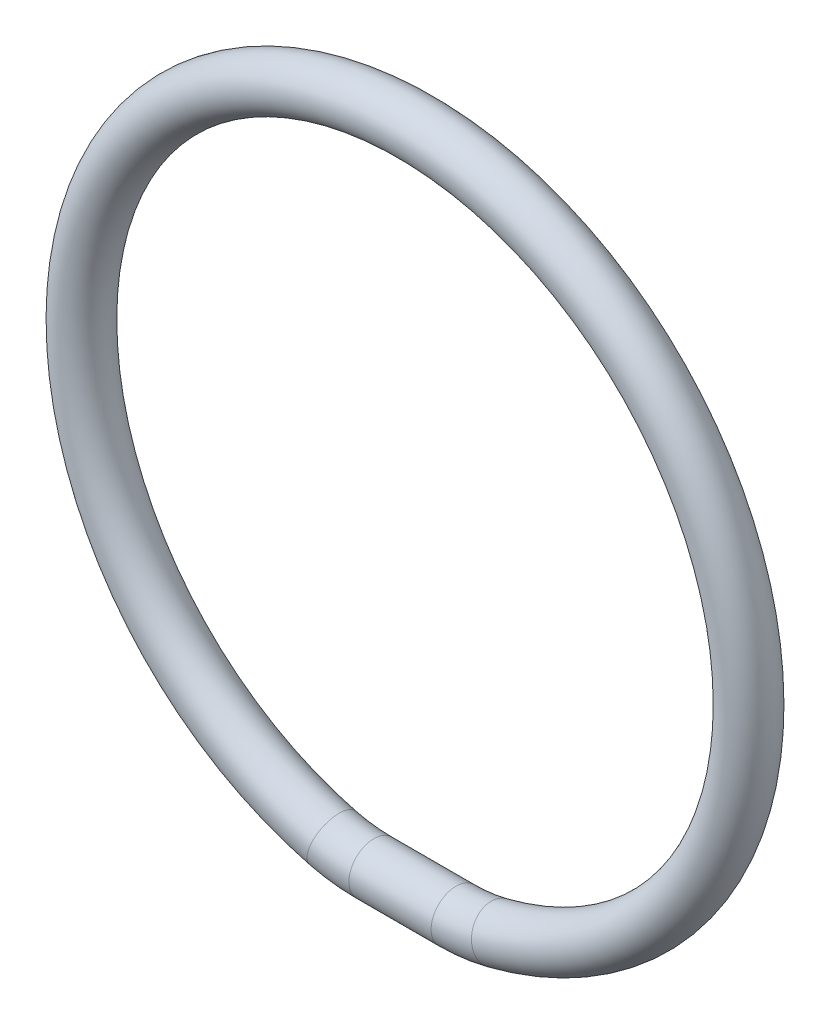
from build123d import *

# Parameters (mm, degrees)
ESQUISSE2_R = 1.5


with BuildPart() as part:
    # Base-Balayage: sweep along a path in Esquisse1
    with BuildLine(Plane.XY) as base_balayage_path:
        Line((-2.46523292, 0), (2.46523292, 0))
        ThreePointArc((2.46523292, 0), (3.707471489, 0.077457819), (4.93046584, 0.308631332))
        ThreePointArc((4.93046584, 0.308631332), (0, 39.691368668), (-4.93046584, 0.308631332))
        ThreePointArc((-4.93046584, 0.308631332), (-3.707471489, 0.077457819), (-2.46523292, 0))
    # Esquisse2 → Base-Balayage (sweep)
    with BuildSketch(Plane(origin=(0, 0, 0), x_dir=(0, 0, -1), z_dir=(1, 0, 0))):
        Circle(ESQUISSE2_R)
    sweep(path=base_balayage_path.line)


solid = part.part
